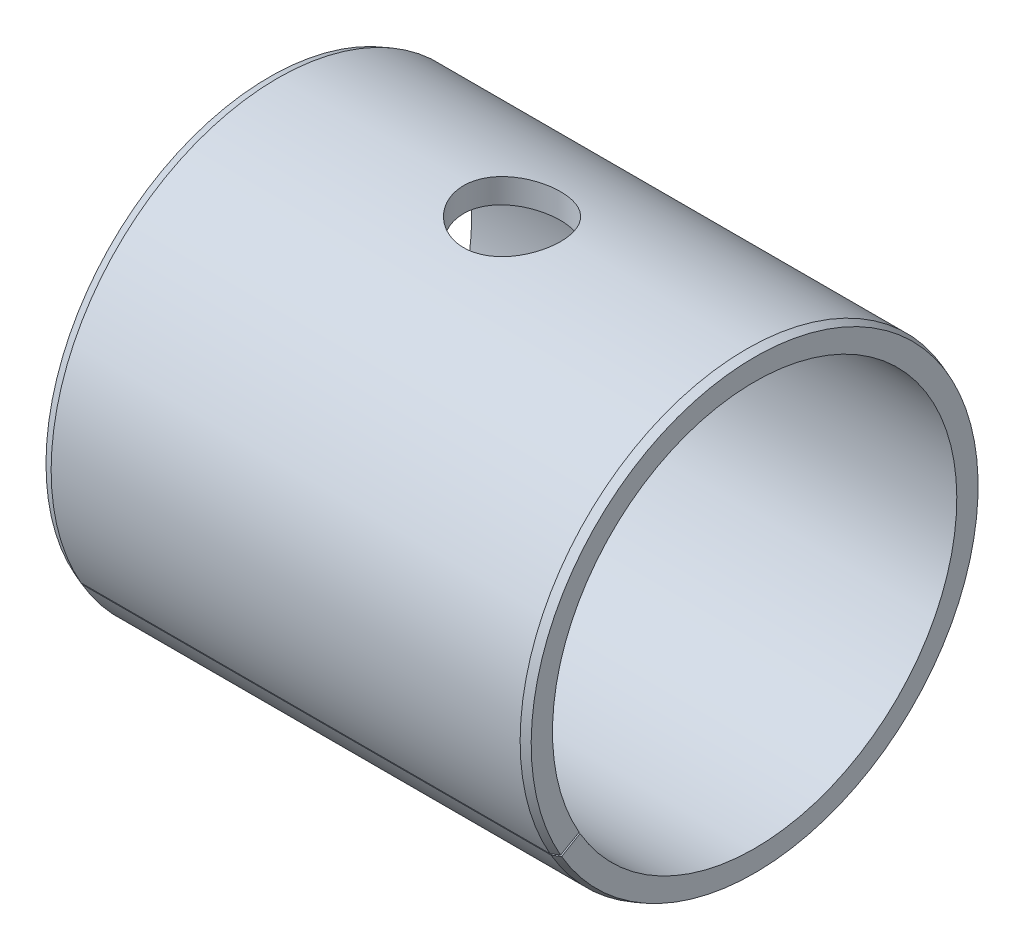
ISO-10303-21;
HEADER;
FILE_DESCRIPTION(('STEP AP214'),'2;1');
FILE_NAME('part.step','',(''),(''),'','','');
FILE_SCHEMA(('AUTOMOTIVE_DESIGN { 1 0 10303 214 1 1 1 1 }'));
ENDSEC;
DATA;
#1=APPLICATION_CONTEXT('core data for automotive mechanical design processes');
#2=APPLICATION_PROTOCOL_DEFINITION('international standard','automotive_design',2000,#1);
#3=PRODUCT_CONTEXT('',#1,'mechanical');
#4=PRODUCT('Part','Part','',(#3));
#5=PRODUCT_RELATED_PRODUCT_CATEGORY('part','',(#4));
#6=PRODUCT_DEFINITION_FORMATION('','',#4);
#7=PRODUCT_DEFINITION_CONTEXT('part definition',#1,'design');
#8=PRODUCT_DEFINITION('design','',#6,#7);
#9=PRODUCT_DEFINITION_SHAPE('','',#8);
#10=(LENGTH_UNIT() NAMED_UNIT(*) SI_UNIT(.MILLI.,.METRE.));
#11=(NAMED_UNIT(*) PLANE_ANGLE_UNIT() SI_UNIT($,.RADIAN.));
#12=(NAMED_UNIT(*) SI_UNIT($,.STERADIAN.) SOLID_ANGLE_UNIT());
#13=UNCERTAINTY_MEASURE_WITH_UNIT(LENGTH_MEASURE(1.E-05),#10,'distance_accuracy_value','');
#14=(GEOMETRIC_REPRESENTATION_CONTEXT(3) GLOBAL_UNCERTAINTY_ASSIGNED_CONTEXT((#13)) GLOBAL_UNIT_ASSIGNED_CONTEXT((#10,
#11,#12)) REPRESENTATION_CONTEXT('',''));
#15=CARTESIAN_POINT('',(0.,0.,0.));
#16=DIRECTION('',(0.,0.,1.));
#17=DIRECTION('',(1.,0.,0.));
#18=AXIS2_PLACEMENT_3D('',#15,#16,#17);
#19=CARTESIAN_POINT('',(0.,0.,0.));
#20=DIRECTION('',(-1.,0.,0.));
#21=DIRECTION('',(0.,-0.863835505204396,-0.503773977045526));
#22=AXIS2_PLACEMENT_3D('',#19,#20,#21);
#23=PLANE('',#22);
#24=CARTESIAN_POINT('',(0.,0.,0.));
#25=DIRECTION('',(-1.,0.,0.));
#26=DIRECTION('',(0.,0.,1.));
#27=AXIS2_PLACEMENT_3D('',#24,#25,#26);
#28=CIRCLE('',#27,12.5);
#29=CARTESIAN_POINT('',(0.,-6.2027062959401,10.8524851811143));
#30=VERTEX_POINT('',#29);
#31=CARTESIAN_POINT('',(0.,-6.29717471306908,10.7979438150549));
#32=VERTEX_POINT('',#31);
#33=EDGE_CURVE('E36',#30,#32,#28,.T.);
#34=ORIENTED_EDGE('',*,*,#33,.F.);
#35=DIRECTION('',(0.,-0.496216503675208,0.868198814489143));
#36=VECTOR('',#35,1.);
#37=CARTESIAN_POINT('',(0.,0.,0.));
#38=LINE('',#37,#36);
#39=CARTESIAN_POINT('',(0.,-6.8567270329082,11.9967841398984));
#40=VERTEX_POINT('',#39);
#41=EDGE_CURVE('E43',#30,#40,#38,.T.);
#42=ORIENTED_EDGE('',*,*,#41,.T.);
#43=CARTESIAN_POINT('',(0.,0.,0.));
#44=DIRECTION('',(-1.,0.,0.));
#45=DIRECTION('',(0.,-0.863835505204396,-0.503773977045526));
#46=AXIS2_PLACEMENT_3D('',#43,#44,#45);
#47=CIRCLE('',#46,13.8180148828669);
#48=CARTESIAN_POINT('',(0.,-6.96115631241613,11.9364918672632));
#49=VERTEX_POINT('',#48);
#50=EDGE_CURVE('E119',#40,#49,#47,.T.);
#51=ORIENTED_EDGE('',*,*,#50,.T.);
#52=DIRECTION('',(0.,-0.503773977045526,0.863835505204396));
#53=VECTOR('',#52,1.);
#54=CARTESIAN_POINT('',(0.,0.,0.));
#55=LINE('',#54,#53);
#56=EDGE_CURVE('E114',#32,#49,#55,.T.);
#57=ORIENTED_EDGE('',*,*,#56,.F.);
#58=EDGE_LOOP('',(#34,#42,#51,#57));
#59=FACE_BOUND('',#58,.T.);
#60=ADVANCED_FACE('F16',(#59),#23,.T.);
#61=CARTESIAN_POINT('',(30.,0.,0.));
#62=DIRECTION('',(-1.,0.,0.));
#63=DIRECTION('',(0.,-0.863835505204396,-0.503773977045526));
#64=AXIS2_PLACEMENT_3D('',#61,#62,#63);
#65=PLANE('',#64);
#66=DIRECTION('',(0.,-0.496216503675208,0.868198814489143));
#67=VECTOR('',#66,1.);
#68=CARTESIAN_POINT('',(30.,0.,0.));
#69=LINE('',#68,#67);
#70=CARTESIAN_POINT('',(30.,-6.2027062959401,10.8524851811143));
#71=VERTEX_POINT('',#70);
#72=CARTESIAN_POINT('',(30.,-6.8567270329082,11.9967841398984));
#73=VERTEX_POINT('',#72);
#74=EDGE_CURVE('E84',#71,#73,#69,.T.);
#75=ORIENTED_EDGE('',*,*,#74,.F.);
#76=CARTESIAN_POINT('',(30.,0.,0.));
#77=DIRECTION('',(-1.,0.,0.));
#78=DIRECTION('',(0.,0.,1.));
#79=AXIS2_PLACEMENT_3D('',#76,#77,#78);
#80=CIRCLE('',#79,12.5);
#81=CARTESIAN_POINT('',(30.,-6.29717471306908,10.7979438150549));
#82=VERTEX_POINT('',#81);
#83=EDGE_CURVE('E74',#71,#82,#80,.T.);
#84=ORIENTED_EDGE('',*,*,#83,.T.);
#85=DIRECTION('',(0.,-0.503773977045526,0.863835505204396));
#86=VECTOR('',#85,1.);
#87=CARTESIAN_POINT('',(30.,0.,0.));
#88=LINE('',#87,#86);
#89=CARTESIAN_POINT('',(30.,-6.96115631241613,11.9364918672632));
#90=VERTEX_POINT('',#89);
#91=EDGE_CURVE('E82',#82,#90,#88,.T.);
#92=ORIENTED_EDGE('',*,*,#91,.T.);
#93=CARTESIAN_POINT('',(30.,0.,0.));
#94=DIRECTION('',(-1.,0.,0.));
#95=DIRECTION('',(0.,-0.863835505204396,-0.503773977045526));
#96=AXIS2_PLACEMENT_3D('',#93,#94,#95);
#97=CIRCLE('',#96,13.8180148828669);
#98=EDGE_CURVE('E30',#73,#90,#97,.T.);
#99=ORIENTED_EDGE('',*,*,#98,.F.);
#100=EDGE_LOOP('',(#75,#84,#92,#99));
#101=FACE_BOUND('',#100,.T.);
#102=ADVANCED_FACE('F18',(#101),#65,.F.);
#103=CARTESIAN_POINT('',(30.,0.,0.));
#104=DIRECTION('',(-1.,0.,0.));
#105=DIRECTION('',(0.,-0.863835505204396,-0.503773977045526));
#106=AXIS2_PLACEMENT_3D('',#103,#104,#105);
#107=CONICAL_SURFACE('',#106,13.8180148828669,0.349065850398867);
#108=CARTESIAN_POINT('',(29.5,0.,0.));
#109=DIRECTION('',(-1.,0.,0.));
#110=DIRECTION('',(0.,-0.863835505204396,-0.503773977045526));
#111=AXIS2_PLACEMENT_3D('',#108,#109,#110);
#112=CIRCLE('',#111,14.);
#113=CARTESIAN_POINT('',(29.5,-6.94703105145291,12.154783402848));
#114=VERTEX_POINT('',#113);
#115=CARTESIAN_POINT('',(29.5,-7.05283567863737,12.0936970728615));
#116=VERTEX_POINT('',#115);
#117=EDGE_CURVE('E136',#114,#116,#112,.T.);
#118=ORIENTED_EDGE('',*,*,#117,.F.);
#119=DIRECTION('',(-0.939692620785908,-0.169716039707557,0.296941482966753));
#120=VECTOR('',#119,1.);
#121=CARTESIAN_POINT('',(30.,-6.8567270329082,11.9967841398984));
#122=LINE('',#121,#120);
#123=EDGE_CURVE('E120',#73,#114,#122,.T.);
#124=ORIENTED_EDGE('',*,*,#123,.F.);
#125=ORIENTED_EDGE('',*,*,#98,.T.);
#126=DIRECTION('',(-0.939692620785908,-0.172300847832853,0.29544914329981));
#127=VECTOR('',#126,1.);
#128=CARTESIAN_POINT('',(30.,-6.96115631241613,11.9364918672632));
#129=LINE('',#128,#127);
#130=EDGE_CURVE('E92',#90,#116,#129,.T.);
#131=ORIENTED_EDGE('',*,*,#130,.T.);
#132=EDGE_LOOP('',(#118,#124,#125,#131));
#133=FACE_BOUND('',#132,.T.);
#134=ADVANCED_FACE('F143',(#133),#107,.T.);
#135=CARTESIAN_POINT('',(0.,0.,0.));
#136=DIRECTION('',(-1.,0.,0.));
#137=DIRECTION('',(0.,-0.863835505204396,-0.503773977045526));
#138=AXIS2_PLACEMENT_3D('',#135,#136,#137);
#139=CYLINDRICAL_SURFACE('',#138,14.);
#140=CARTESIAN_POINT('',(18.,14.,0.));
#141=CARTESIAN_POINT('',(17.9999942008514,13.9999969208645,-0.166471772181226));
#142=CARTESIAN_POINT('',(17.9860967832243,13.9970005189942,-0.333014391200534));
#143=CARTESIAN_POINT('',(17.9309286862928,13.9853365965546,-0.661374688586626));
#144=CARTESIAN_POINT('',(17.8896379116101,13.976664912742,-0.823188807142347));
#145=CARTESIAN_POINT('',(17.7810312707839,13.9546166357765,-1.13729864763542));
#146=CARTESIAN_POINT('',(17.7137420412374,13.9412448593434,-1.28960392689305));
#147=CARTESIAN_POINT('',(17.5551318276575,13.9112421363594,-1.58075635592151));
#148=CARTESIAN_POINT('',(17.4638116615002,13.8946113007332,-1.71960396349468));
#149=CARTESIAN_POINT('',(17.2582394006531,13.8596273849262,-1.9820495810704));
#150=CARTESIAN_POINT('',(17.143687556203,13.8412536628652,-2.10541006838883));
#151=CARTESIAN_POINT('',(16.8955473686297,13.8050013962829,-2.33132084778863));
#152=CARTESIAN_POINT('',(16.7619573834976,13.7871228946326,-2.43386934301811));
#153=CARTESIAN_POINT('',(16.4777884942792,13.7536823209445,-2.61628408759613));
#154=CARTESIAN_POINT('',(16.3270449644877,13.7381467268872,-2.69589916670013));
#155=CARTESIAN_POINT('',(16.0139310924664,13.7114465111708,-2.82857647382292));
#156=CARTESIAN_POINT('',(15.8515620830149,13.7002813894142,-2.88164174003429));
#157=CARTESIAN_POINT('',(15.5223778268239,13.6837961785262,-2.95893148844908));
#158=CARTESIAN_POINT('',(15.3556654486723,13.6783911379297,-2.98357559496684));
#159=CARTESIAN_POINT('',(15.0203915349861,13.6737827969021,-3.00462790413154));
#160=CARTESIAN_POINT('',(14.8518302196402,13.6745787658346,-3.0010394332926));
#161=CARTESIAN_POINT('',(14.5207506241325,13.6822055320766,-2.96606652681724));
#162=CARTESIAN_POINT('',(14.3581782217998,13.6889308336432,-2.93516797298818));
#163=CARTESIAN_POINT('',(14.0405795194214,13.7074918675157,-2.84722108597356));
#164=CARTESIAN_POINT('',(13.8855536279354,13.719327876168,-2.79017133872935));
#165=CARTESIAN_POINT('',(13.5860742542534,13.7468816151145,-2.65109102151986));
#166=CARTESIAN_POINT('',(13.441710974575,13.7626284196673,-2.56887221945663));
#167=CARTESIAN_POINT('',(13.1686496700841,13.7962114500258,-2.38192014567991));
#168=CARTESIAN_POINT('',(13.0399537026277,13.8140479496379,-2.2771839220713));
#169=CARTESIAN_POINT('',(12.7990812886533,13.8502543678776,-2.04559085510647));
#170=CARTESIAN_POINT('',(12.6873025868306,13.8686276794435,-1.91832046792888));
#171=CARTESIAN_POINT('',(12.4866125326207,13.9035003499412,-1.64663461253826));
#172=CARTESIAN_POINT('',(12.3977015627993,13.9199996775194,-1.50221885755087));
#173=CARTESIAN_POINT('',(12.2451786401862,13.94931557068,-1.1998669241));
#174=CARTESIAN_POINT('',(12.1816171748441,13.9621247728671,-1.04190451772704));
#175=CARTESIAN_POINT('',(12.0820487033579,13.9825621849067,-0.717206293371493));
#176=CARTESIAN_POINT('',(12.0460378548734,13.9901911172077,-0.55047170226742));
#177=CARTESIAN_POINT('',(12.0031675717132,13.9993061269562,-0.216375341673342));
#178=CARTESIAN_POINT('',(11.9957645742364,14.0009067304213,-0.0490863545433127));
#179=CARTESIAN_POINT('',(12.0088491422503,13.9981049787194,0.284337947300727));
#180=CARTESIAN_POINT('',(12.0293348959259,13.993703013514,0.450473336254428));
#181=CARTESIAN_POINT('',(12.0971644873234,13.9794628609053,0.775085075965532));
#182=CARTESIAN_POINT('',(12.144224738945,13.9696821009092,0.933623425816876));
#183=CARTESIAN_POINT('',(12.2635538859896,13.9457784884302,1.24055690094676));
#184=CARTESIAN_POINT('',(12.3358248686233,13.9316552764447,1.38895118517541));
#185=CARTESIAN_POINT('',(12.5046670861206,13.900350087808,1.67364279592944));
#186=CARTESIAN_POINT('',(12.6015595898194,13.8831286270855,1.80974515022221));
#187=CARTESIAN_POINT('',(12.8164696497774,13.847620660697,2.06395385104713));
#188=CARTESIAN_POINT('',(12.9344898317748,13.8293340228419,2.18205795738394));
#189=CARTESIAN_POINT('',(13.1907947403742,13.7933634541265,2.39905422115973));
#190=CARTESIAN_POINT('',(13.3294001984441,13.7756958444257,2.49757074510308));
#191=CARTESIAN_POINT('',(13.6215091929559,13.7433330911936,2.66992830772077));
#192=CARTESIAN_POINT('',(13.7750120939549,13.7286378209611,2.74377039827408));
#193=CARTESIAN_POINT('',(14.0917445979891,13.7040201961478,2.86419482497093));
#194=CARTESIAN_POINT('',(14.2549147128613,13.6940714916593,2.91092797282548));
#195=CARTESIAN_POINT('',(14.5870311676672,13.6800237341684,2.97625392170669));
#196=CARTESIAN_POINT('',(14.7559766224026,13.6759237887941,2.99485101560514));
#197=CARTESIAN_POINT('',(15.0910646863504,13.6740923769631,3.00319999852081));
#198=CARTESIAN_POINT('',(15.2571920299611,13.6762295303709,2.99354694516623));
#199=CARTESIAN_POINT('',(15.5853944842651,13.6863352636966,2.94699578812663));
#200=CARTESIAN_POINT('',(15.7474696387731,13.6943037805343,2.9100979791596));
#201=CARTESIAN_POINT('',(16.0625173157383,13.7151116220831,2.8103869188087));
#202=CARTESIAN_POINT('',(16.2155172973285,13.7279352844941,2.74765694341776));
#203=CARTESIAN_POINT('',(16.5089107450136,13.757015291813,2.59813503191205));
#204=CARTESIAN_POINT('',(16.64930295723,13.7732719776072,2.51134070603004));
#205=CARTESIAN_POINT('',(16.9164363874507,13.8077811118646,2.31416580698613));
#206=CARTESIAN_POINT('',(17.0428593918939,13.8260661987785,2.20335974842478));
#207=CARTESIAN_POINT('',(17.2755125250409,13.8623489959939,1.9621731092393));
#208=CARTESIAN_POINT('',(17.3817379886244,13.8803466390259,1.83178801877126));
#209=CARTESIAN_POINT('',(17.5722319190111,13.9142898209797,1.55320629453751));
#210=CARTESIAN_POINT('',(17.6562132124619,13.9302072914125,1.40480969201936));
#211=CARTESIAN_POINT('',(17.7979090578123,13.9579165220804,1.09570032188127));
#212=CARTESIAN_POINT('',(17.85564604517,13.9697118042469,0.934998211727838));
#213=CARTESIAN_POINT('',(17.9327043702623,13.9856969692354,0.645070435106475));
#214=CARTESIAN_POINT('',(17.9578928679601,13.9910278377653,0.517434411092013));
#215=CARTESIAN_POINT('',(17.9915426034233,13.9981804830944,0.25987992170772));
#216=CARTESIAN_POINT('',(18.0000045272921,14.0000024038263,0.129961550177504));
#217=CARTESIAN_POINT('',(18.,14.,0.));
#218=B_SPLINE_CURVE_WITH_KNOTS('',3,(#140,#141,#142,#143,#144,#145,#146,#147,#148,#149,#150,
#151,#152,#153,#154,#155,#156,#157,#158,#159,#160,#161,#162,#163,#164,#165,#166,#167,#168,#169,
#170,#171,#172,#173,#174,#175,#176,#177,#178,#179,#180,#181,#182,#183,#184,#185,#186,#187,#188,
#189,#190,#191,#192,#193,#194,#195,#196,#197,#198,#199,#200,#201,#202,#203,#204,#205,#206,#207,
#208,#209,#210,#211,#212,#213,#214,#215,#216,#217),.UNSPECIFIED.,.T.,.F.,(4,2,2,2,2,2,2,2,2,2,2,
2,2,2,2,2,2,2,2,2,2,2,2,2,2,2,2,2,2,2,2,2,2,2,2,2,2,2,4),(0.,0.498939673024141,
0.998245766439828,1.49704164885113,1.99582055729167,2.50149923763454,3.00722155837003,
3.51828858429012,4.02929711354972,4.53266016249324,5.03596390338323,5.53048950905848,
6.0250418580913,6.52338712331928,7.02179775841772,7.53054022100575,8.03929119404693,
8.54905042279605,9.05873854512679,9.55869331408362,10.0586156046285,10.5533012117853,
11.0480277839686,11.549574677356,12.0511839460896,12.5616412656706,13.072076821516,
13.5796448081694,14.0871353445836,14.5840136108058,15.0808865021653,15.5761699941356,
16.0715026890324,16.5764590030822,17.0815318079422,17.5928382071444,18.1037066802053,
18.4932359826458,18.8827493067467),.UNSPECIFIED.);
#219=CARTESIAN_POINT('',(18.,14.,0.));
#220=VERTEX_POINT('',#219);
#221=EDGE_CURVE('E86',#220,#220,#218,.T.);
#222=ORIENTED_EDGE('',*,*,#221,.F.);
#223=EDGE_LOOP('',(#222));
#224=FACE_BOUND('',#223,.T.);
#225=CARTESIAN_POINT('',(0.5,0.,0.));
#226=DIRECTION('',(-1.,0.,0.));
#227=DIRECTION('',(0.,-0.863835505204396,-0.503773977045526));
#228=AXIS2_PLACEMENT_3D('',#225,#226,#227);
#229=CIRCLE('',#228,14.);
#230=CARTESIAN_POINT('',(0.5,-6.94703105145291,12.154783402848));
#231=VERTEX_POINT('',#230);
#232=CARTESIAN_POINT('',(0.5,-7.05283567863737,12.0936970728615));
#233=VERTEX_POINT('',#232);
#234=EDGE_CURVE('E133',#231,#233,#229,.T.);
#235=ORIENTED_EDGE('',*,*,#234,.F.);
#236=DIRECTION('',(1.,0.,0.));
#237=VECTOR('',#236,1.);
#238=CARTESIAN_POINT('',(0.5,-6.94703105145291,12.154783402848));
#239=LINE('',#238,#237);
#240=EDGE_CURVE('E124',#231,#114,#239,.T.);
#241=ORIENTED_EDGE('',*,*,#240,.T.);
#242=ORIENTED_EDGE('',*,*,#117,.T.);
#243=DIRECTION('',(1.,0.,0.));
#244=VECTOR('',#243,1.);
#245=CARTESIAN_POINT('',(0.5,-7.05283567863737,12.0936970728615));
#246=LINE('',#245,#244);
#247=EDGE_CURVE('E102',#233,#116,#246,.T.);
#248=ORIENTED_EDGE('',*,*,#247,.F.);
#249=EDGE_LOOP('',(#235,#241,#242,#248));
#250=FACE_BOUND('',#249,.T.);
#251=ADVANCED_FACE('F160',(#224,#250),#139,.T.);
#252=CARTESIAN_POINT('',(0.5,0.,0.));
#253=DIRECTION('',(1.,0.,0.));
#254=DIRECTION('',(0.,0.863835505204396,0.503773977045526));
#255=AXIS2_PLACEMENT_3D('',#252,#253,#254);
#256=CONICAL_SURFACE('',#255,14.,0.349065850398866);
#257=DIRECTION('',(-0.939692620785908,0.169716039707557,-0.296941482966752));
#258=VECTOR('',#257,1.);
#259=CARTESIAN_POINT('',(0.5,-6.94703105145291,12.154783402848));
#260=LINE('',#259,#258);
#261=EDGE_CURVE('E99',#231,#40,#260,.T.);
#262=ORIENTED_EDGE('',*,*,#261,.F.);
#263=ORIENTED_EDGE('',*,*,#234,.T.);
#264=DIRECTION('',(-0.939692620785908,0.172300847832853,-0.295449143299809));
#265=VECTOR('',#264,1.);
#266=CARTESIAN_POINT('',(0.5,-7.05283567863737,12.0936970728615));
#267=LINE('',#266,#265);
#268=EDGE_CURVE('E110',#233,#49,#267,.T.);
#269=ORIENTED_EDGE('',*,*,#268,.T.);
#270=ORIENTED_EDGE('',*,*,#50,.F.);
#271=EDGE_LOOP('',(#262,#263,#269,#270));
#272=FACE_BOUND('',#271,.T.);
#273=ADVANCED_FACE('F174',(#272),#256,.T.);
#274=CARTESIAN_POINT('',(0.,-6.94703105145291,12.154783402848));
#275=DIRECTION('',(0.,0.868198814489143,0.496216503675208));
#276=DIRECTION('',(-1.,0.,0.));
#277=AXIS2_PLACEMENT_3D('',#274,#275,#276);
#278=PLANE('',#277);
#279=ORIENTED_EDGE('',*,*,#41,.F.);
#280=DIRECTION('',(1.,0.,0.));
#281=VECTOR('',#280,1.);
#282=CARTESIAN_POINT('',(-1.,-6.2027062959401,10.8524851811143));
#283=LINE('',#282,#281);
#284=EDGE_CURVE('E105',#30,#71,#283,.T.);
#285=ORIENTED_EDGE('',*,*,#284,.T.);
#286=ORIENTED_EDGE('',*,*,#74,.T.);
#287=ORIENTED_EDGE('',*,*,#123,.T.);
#288=ORIENTED_EDGE('',*,*,#240,.F.);
#289=ORIENTED_EDGE('',*,*,#261,.T.);
#290=EDGE_LOOP('',(#279,#285,#286,#287,#288,#289));
#291=FACE_BOUND('',#290,.T.);
#292=ADVANCED_FACE('F146',(#291),#278,.F.);
#293=CARTESIAN_POINT('',(0.,-7.05283567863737,12.0936970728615));
#294=DIRECTION('',(0.,0.863835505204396,0.503773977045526));
#295=DIRECTION('',(-1.,0.,0.));
#296=AXIS2_PLACEMENT_3D('',#293,#294,#295);
#297=PLANE('',#296);
#298=DIRECTION('',(1.,0.,0.));
#299=VECTOR('',#298,1.);
#300=CARTESIAN_POINT('',(-1.,-6.29717471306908,10.7979438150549));
#301=LINE('',#300,#299);
#302=EDGE_CURVE('E10',#32,#82,#301,.T.);
#303=ORIENTED_EDGE('',*,*,#302,.F.);
#304=ORIENTED_EDGE('',*,*,#56,.T.);
#305=ORIENTED_EDGE('',*,*,#268,.F.);
#306=ORIENTED_EDGE('',*,*,#247,.T.);
#307=ORIENTED_EDGE('',*,*,#130,.F.);
#308=ORIENTED_EDGE('',*,*,#91,.F.);
#309=EDGE_LOOP('',(#303,#304,#305,#306,#307,#308));
#310=FACE_BOUND('',#309,.T.);
#311=ADVANCED_FACE('F89',(#310),#297,.T.);
#312=CARTESIAN_POINT('',(-1.,0.,0.));
#313=DIRECTION('',(1.,0.,0.));
#314=DIRECTION('',(0.,-1.,0.));
#315=AXIS2_PLACEMENT_3D('',#312,#313,#314);
#316=CYLINDRICAL_SURFACE('',#315,12.5);
#317=CARTESIAN_POINT('',(18.,12.5,0.));
#318=CARTESIAN_POINT('',(17.9999949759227,12.4999970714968,-0.165963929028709));
#319=CARTESIAN_POINT('',(17.9861815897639,12.4966615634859,-0.331985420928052));
#320=CARTESIAN_POINT('',(17.9313672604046,12.4836783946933,-0.659284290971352));
#321=CARTESIAN_POINT('',(17.8903495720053,12.4740268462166,-0.820558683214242));
#322=CARTESIAN_POINT('',(17.7825076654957,12.4494823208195,-1.13358839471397));
#323=CARTESIAN_POINT('',(17.7157131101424,12.4345953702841,-1.28535442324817));
#324=CARTESIAN_POINT('',(17.5583145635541,12.4011725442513,-1.57552517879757));
#325=CARTESIAN_POINT('',(17.4677102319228,12.3826366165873,-1.7139297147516));
#326=CARTESIAN_POINT('',(17.2634358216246,12.3435386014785,-1.97609263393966));
#327=CARTESIAN_POINT('',(17.1493972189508,12.3229472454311,-2.09955952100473));
#328=CARTESIAN_POINT('',(16.9022811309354,12.2822574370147,-2.32581080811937));
#329=CARTESIAN_POINT('',(16.7692016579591,12.2621590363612,-2.42859304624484));
#330=CARTESIAN_POINT('',(16.4855541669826,12.224437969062,-2.61189993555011));
#331=CARTESIAN_POINT('',(16.3347734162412,12.2068525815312,-2.69210377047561));
#332=CARTESIAN_POINT('',(16.0213801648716,12.1765733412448,-2.82591582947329));
#333=CARTESIAN_POINT('',(15.8587693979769,12.1638787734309,-2.87952794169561));
#334=CARTESIAN_POINT('',(15.5295234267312,12.1451184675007,-2.95765058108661));
#335=CARTESIAN_POINT('',(15.3630188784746,12.1389341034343,-2.98268262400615));
#336=CARTESIAN_POINT('',(15.0280676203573,12.1335389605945,-3.00455808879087));
#337=CARTESIAN_POINT('',(14.8596212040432,12.1343271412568,-3.001405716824));
#338=CARTESIAN_POINT('',(14.5295240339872,12.1426811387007,-2.96741912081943));
#339=CARTESIAN_POINT('',(14.3678054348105,12.1500960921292,-2.93720103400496));
#340=CARTESIAN_POINT('',(14.0518026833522,12.1706283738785,-2.85092141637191));
#341=CARTESIAN_POINT('',(13.8975190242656,12.1837460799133,-2.7948581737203));
#342=CARTESIAN_POINT('',(13.5990870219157,12.2143476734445,-2.65794121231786));
#343=CARTESIAN_POINT('',(13.4550475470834,12.2318714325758,-2.57685948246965));
#344=CARTESIAN_POINT('',(13.1823954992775,12.2692875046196,-2.39236688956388));
#345=CARTESIAN_POINT('',(13.053785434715,12.2891802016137,-2.28895240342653));
#346=CARTESIAN_POINT('',(12.8121064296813,12.329732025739,-2.05951493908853));
#347=CARTESIAN_POINT('',(12.6995329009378,12.3503975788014,-1.93297064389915));
#348=CARTESIAN_POINT('',(12.4971152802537,12.3896951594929,-1.66255592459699));
#349=CARTESIAN_POINT('',(12.4072717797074,12.4083271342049,-1.51868504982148));
#350=CARTESIAN_POINT('',(12.2527027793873,12.4415394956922,-1.21702847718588));
#351=CARTESIAN_POINT('',(12.1880525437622,12.4561077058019,-1.05920278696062));
#352=CARTESIAN_POINT('',(12.0863349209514,12.4794620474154,-0.73449760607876));
#353=CARTESIAN_POINT('',(12.0492626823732,12.4882491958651,-0.567619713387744));
#354=CARTESIAN_POINT('',(12.004497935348,12.4989027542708,-0.233787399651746));
#355=CARTESIAN_POINT('',(11.9961301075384,12.5009282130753,-0.0669284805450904));
#356=CARTESIAN_POINT('',(12.0071667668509,12.4982807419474,0.265804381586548));
#357=CARTESIAN_POINT('',(12.0265689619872,12.4936083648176,0.431678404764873));
#358=CARTESIAN_POINT('',(12.0920369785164,12.4781916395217,0.755422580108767));
#359=CARTESIAN_POINT('',(12.1377391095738,12.4675301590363,0.913370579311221));
#360=CARTESIAN_POINT('',(12.2540981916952,12.4413335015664,1.21935330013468));
#361=CARTESIAN_POINT('',(12.3247575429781,12.4257978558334,1.36738706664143));
#362=CARTESIAN_POINT('',(12.4903665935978,12.3911910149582,1.65206150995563));
#363=CARTESIAN_POINT('',(12.5857007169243,12.3720653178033,1.78847176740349));
#364=CARTESIAN_POINT('',(12.7974569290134,12.3324936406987,2.04359904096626));
#365=CARTESIAN_POINT('',(12.9138823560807,12.3120474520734,2.16231325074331));
#366=CARTESIAN_POINT('',(13.1676408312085,12.2715742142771,2.38142453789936));
#367=CARTESIAN_POINT('',(13.305385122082,12.2515669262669,2.48134974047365));
#368=CARTESIAN_POINT('',(13.5960904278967,12.2147538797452,2.65666020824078));
#369=CARTESIAN_POINT('',(13.7490507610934,12.1979479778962,2.73204657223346));
#370=CARTESIAN_POINT('',(14.0650125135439,12.1696189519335,2.85558993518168));
#371=CARTESIAN_POINT('',(14.2279482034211,12.1580647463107,2.90390754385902));
#372=CARTESIAN_POINT('',(14.5599461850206,12.1415072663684,2.97238380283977));
#373=CARTESIAN_POINT('',(14.7290072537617,12.1365026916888,2.9925480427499));
#374=CARTESIAN_POINT('',(15.0636707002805,12.1337046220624,3.00387066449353));
#375=CARTESIAN_POINT('',(15.2292464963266,12.1357241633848,2.99578106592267));
#376=CARTESIAN_POINT('',(15.5565997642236,12.1463176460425,2.95253345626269));
#377=CARTESIAN_POINT('',(15.7183773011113,12.1548914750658,2.91737590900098));
#378=CARTESIAN_POINT('',(16.0327975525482,12.1775274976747,2.8213859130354));
#379=CARTESIAN_POINT('',(16.1854822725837,12.191561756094,2.76068402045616));
#380=CARTESIAN_POINT('',(16.4786044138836,12.2235433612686,2.61543373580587));
#381=CARTESIAN_POINT('',(16.6190402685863,12.2414912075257,2.53088229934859));
#382=CARTESIAN_POINT('',(16.8873370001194,12.279819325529,2.33793007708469));
#383=CARTESIAN_POINT('',(17.0148123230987,12.3002478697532,2.22900267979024));
#384=CARTESIAN_POINT('',(17.2499199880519,12.3409359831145,1.99143074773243));
#385=CARTESIAN_POINT('',(17.3575476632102,12.361195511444,1.86278158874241));
#386=CARTESIAN_POINT('',(17.5516092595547,12.3996570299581,1.58688299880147));
#387=CARTESIAN_POINT('',(17.637668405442,12.4178200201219,1.43936414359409));
#388=CARTESIAN_POINT('',(17.7836295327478,12.4496380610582,1.13153622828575));
#389=CARTESIAN_POINT('',(17.8435513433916,12.4632965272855,0.971236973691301));
#390=CARTESIAN_POINT('',(17.9260386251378,12.4824059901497,0.675887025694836));
#391=CARTESIAN_POINT('',(17.9537166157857,12.4889599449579,0.54231206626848));
#392=CARTESIAN_POINT('',(17.9906987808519,12.4977580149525,0.27250422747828));
#393=CARTESIAN_POINT('',(18.0000041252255,12.5000024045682,0.136271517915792));
#394=CARTESIAN_POINT('',(18.,12.5,0.));
#395=B_SPLINE_CURVE_WITH_KNOTS('',3,(#317,#318,#319,#320,#321,#322,#323,#324,#325,#326,#327,
#328,#329,#330,#331,#332,#333,#334,#335,#336,#337,#338,#339,#340,#341,#342,#343,#344,#345,#346,
#347,#348,#349,#350,#351,#352,#353,#354,#355,#356,#357,#358,#359,#360,#361,#362,#363,#364,#365,
#366,#367,#368,#369,#370,#371,#372,#373,#374,#375,#376,#377,#378,#379,#380,#381,#382,#383,#384,
#385,#386,#387,#388,#389,#390,#391,#392,#393,#394),.UNSPECIFIED.,.T.,.F.,(4,2,2,2,2,2,2,2,2,2,2,
2,2,2,2,2,2,2,2,2,2,2,2,2,2,2,2,2,2,2,2,2,2,2,2,2,2,2,4),(0.,0.497392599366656,
0.995091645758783,1.49221966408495,1.9893547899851,2.49500570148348,3.00070943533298,
3.5132726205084,4.02576083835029,4.52873995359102,5.03164400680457,5.52338274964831,
6.0151540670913,6.51154667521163,7.00801987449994,7.51749958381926,8.02699254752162,
8.53799614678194,9.04890983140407,9.54771776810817,10.0464845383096,10.538514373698,
11.030591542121,11.5308523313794,12.031192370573,12.5427824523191,13.0543496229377,
13.5628484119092,14.0712462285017,14.5662165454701,15.0611783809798,15.5536406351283,
16.0461657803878,16.550584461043,17.0551215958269,17.5678974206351,18.0802835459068,
18.488714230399,18.897118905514),.UNSPECIFIED.);
#396=CARTESIAN_POINT('',(18.,12.5,0.));
#397=VERTEX_POINT('',#396);
#398=EDGE_CURVE('E20',#397,#397,#395,.T.);
#399=ORIENTED_EDGE('',*,*,#398,.T.);
#400=EDGE_LOOP('',(#399));
#401=FACE_BOUND('',#400,.T.);
#402=ORIENTED_EDGE('',*,*,#33,.T.);
#403=ORIENTED_EDGE('',*,*,#302,.T.);
#404=ORIENTED_EDGE('',*,*,#83,.F.);
#405=ORIENTED_EDGE('',*,*,#284,.F.);
#406=EDGE_LOOP('',(#402,#403,#404,#405));
#407=FACE_BOUND('',#406,.T.);
#408=ADVANCED_FACE('F73',(#401,#407),#316,.F.);
#409=CARTESIAN_POINT('',(15.,0.,0.));
#410=DIRECTION('',(0.,1.,0.));
#411=DIRECTION('',(1.,0.,0.));
#412=AXIS2_PLACEMENT_3D('',#409,#410,#411);
#413=CYLINDRICAL_SURFACE('',#412,3.);
#414=ORIENTED_EDGE('',*,*,#221,.T.);
#415=EDGE_LOOP('',(#414));
#416=FACE_BOUND('',#415,.T.);
#417=ORIENTED_EDGE('',*,*,#398,.F.);
#418=EDGE_LOOP('',(#417));
#419=FACE_BOUND('',#418,.T.);
#420=ADVANCED_FACE('F163',(#416,#419),#413,.F.);
#421=CLOSED_SHELL('',(#60,#102,#134,#251,#273,#292,#311,#408,#420));
#422=MANIFOLD_SOLID_BREP('B1',#421);
#423=ADVANCED_BREP_SHAPE_REPRESENTATION('',(#18,#422),#14);
#424=SHAPE_DEFINITION_REPRESENTATION(#9,#423);
ENDSEC;
END-ISO-10303-21;
